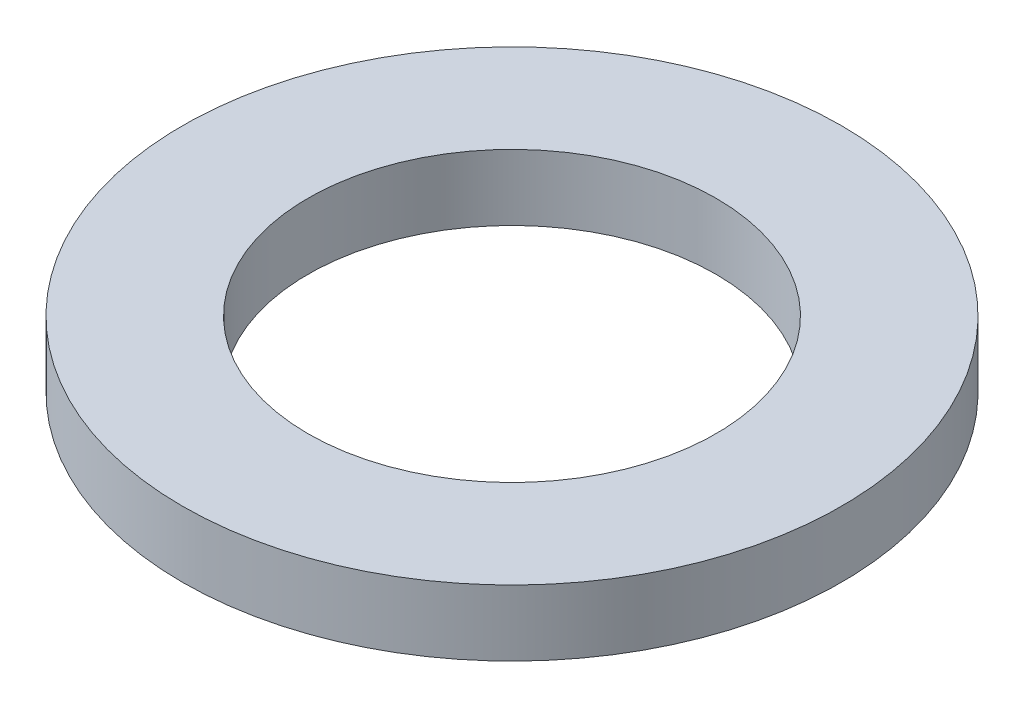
ISO-10303-21;
HEADER;
FILE_DESCRIPTION(('STEP AP214'),'2;1');
FILE_NAME('part.step','',(''),(''),'','','');
FILE_SCHEMA(('AUTOMOTIVE_DESIGN { 1 0 10303 214 1 1 1 1 }'));
ENDSEC;
DATA;
#1=APPLICATION_CONTEXT('core data for automotive mechanical design processes');
#2=APPLICATION_PROTOCOL_DEFINITION('international standard','automotive_design',2000,#1);
#3=PRODUCT_CONTEXT('',#1,'mechanical');
#4=PRODUCT('Part','Part','',(#3));
#5=PRODUCT_RELATED_PRODUCT_CATEGORY('part','',(#4));
#6=PRODUCT_DEFINITION_FORMATION('','',#4);
#7=PRODUCT_DEFINITION_CONTEXT('part definition',#1,'design');
#8=PRODUCT_DEFINITION('design','',#6,#7);
#9=PRODUCT_DEFINITION_SHAPE('','',#8);
#10=(LENGTH_UNIT() NAMED_UNIT(*) SI_UNIT(.MILLI.,.METRE.));
#11=(NAMED_UNIT(*) PLANE_ANGLE_UNIT() SI_UNIT($,.RADIAN.));
#12=(NAMED_UNIT(*) SI_UNIT($,.STERADIAN.) SOLID_ANGLE_UNIT());
#13=UNCERTAINTY_MEASURE_WITH_UNIT(LENGTH_MEASURE(1.E-05),#10,'distance_accuracy_value','');
#14=(GEOMETRIC_REPRESENTATION_CONTEXT(3) GLOBAL_UNCERTAINTY_ASSIGNED_CONTEXT((#13)) GLOBAL_UNIT_ASSIGNED_CONTEXT((#10,
#11,#12)) REPRESENTATION_CONTEXT('',''));
#15=CARTESIAN_POINT('',(0.,0.,0.));
#16=DIRECTION('',(0.,0.,1.));
#17=DIRECTION('',(1.,0.,0.));
#18=AXIS2_PLACEMENT_3D('',#15,#16,#17);
#19=CARTESIAN_POINT('',(0.,1.60020000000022,0.));
#20=DIRECTION('',(0.,1.,0.));
#21=DIRECTION('',(0.,0.,1.));
#22=AXIS2_PLACEMENT_3D('',#19,#20,#21);
#23=PLANE('',#22);
#24=CARTESIAN_POINT('',(0.,1.60020000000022,0.));
#25=DIRECTION('',(0.,-1.,0.));
#26=DIRECTION('',(0.,0.,-1.));
#27=AXIS2_PLACEMENT_3D('',#24,#25,#26);
#28=CIRCLE('',#27,4.953);
#29=CARTESIAN_POINT('',(0.,1.60020000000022,-4.95299999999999));
#30=VERTEX_POINT('',#29);
#31=EDGE_CURVE('E27',#30,#30,#28,.T.);
#32=ORIENTED_EDGE('',*,*,#31,.T.);
#33=EDGE_LOOP('',(#32));
#34=FACE_BOUND('',#33,.T.);
#35=CARTESIAN_POINT('',(0.,1.60020000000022,0.));
#36=DIRECTION('',(0.,-1.,0.));
#37=DIRECTION('',(0.,0.,-1.));
#38=AXIS2_PLACEMENT_3D('',#35,#36,#37);
#39=CIRCLE('',#38,8.001);
#40=CARTESIAN_POINT('',(0.,1.60020000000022,-8.00099999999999));
#41=VERTEX_POINT('',#40);
#42=EDGE_CURVE('E18',#41,#41,#39,.T.);
#43=ORIENTED_EDGE('',*,*,#42,.F.);
#44=EDGE_LOOP('',(#43));
#45=FACE_BOUND('',#44,.T.);
#46=ADVANCED_FACE('F15',(#34,#45),#23,.T.);
#47=CARTESIAN_POINT('',(0.,1.60020000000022,0.));
#48=DIRECTION('',(0.,-1.,0.));
#49=DIRECTION('',(0.,0.,-1.));
#50=AXIS2_PLACEMENT_3D('',#47,#48,#49);
#51=CYLINDRICAL_SURFACE('',#50,8.001);
#52=ORIENTED_EDGE('',*,*,#42,.T.);
#53=EDGE_LOOP('',(#52));
#54=FACE_BOUND('',#53,.T.);
#55=CARTESIAN_POINT('',(0.,0.,0.));
#56=DIRECTION('',(0.,-1.,0.));
#57=DIRECTION('',(0.,0.,-1.));
#58=AXIS2_PLACEMENT_3D('',#55,#56,#57);
#59=CIRCLE('',#58,8.001);
#60=CARTESIAN_POINT('',(0.,0.,-8.00099999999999));
#61=VERTEX_POINT('',#60);
#62=EDGE_CURVE('E22',#61,#61,#59,.F.);
#63=ORIENTED_EDGE('',*,*,#62,.T.);
#64=EDGE_LOOP('',(#63));
#65=FACE_BOUND('',#64,.T.);
#66=ADVANCED_FACE('F35',(#54,#65),#51,.T.);
#67=CARTESIAN_POINT('',(0.,1.60020000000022,0.));
#68=DIRECTION('',(0.,-1.,0.));
#69=DIRECTION('',(0.,0.,-1.));
#70=AXIS2_PLACEMENT_3D('',#67,#68,#69);
#71=CYLINDRICAL_SURFACE('',#70,4.953);
#72=CARTESIAN_POINT('',(0.,0.,0.));
#73=DIRECTION('',(0.,-1.,0.));
#74=DIRECTION('',(0.,0.,-1.));
#75=AXIS2_PLACEMENT_3D('',#72,#73,#74);
#76=CIRCLE('',#75,4.953);
#77=CARTESIAN_POINT('',(0.,0.,-4.95299999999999));
#78=VERTEX_POINT('',#77);
#79=EDGE_CURVE('E10',#78,#78,#76,.T.);
#80=ORIENTED_EDGE('',*,*,#79,.T.);
#81=EDGE_LOOP('',(#80));
#82=FACE_BOUND('',#81,.T.);
#83=ORIENTED_EDGE('',*,*,#31,.F.);
#84=EDGE_LOOP('',(#83));
#85=FACE_BOUND('',#84,.T.);
#86=ADVANCED_FACE('F43',(#82,#85),#71,.F.);
#87=CARTESIAN_POINT('',(0.,0.,0.));
#88=DIRECTION('',(0.,1.,0.));
#89=DIRECTION('',(0.,0.,1.));
#90=AXIS2_PLACEMENT_3D('',#87,#88,#89);
#91=PLANE('',#90);
#92=ORIENTED_EDGE('',*,*,#79,.F.);
#93=EDGE_LOOP('',(#92));
#94=FACE_BOUND('',#93,.T.);
#95=ORIENTED_EDGE('',*,*,#62,.F.);
#96=EDGE_LOOP('',(#95));
#97=FACE_BOUND('',#96,.T.);
#98=ADVANCED_FACE('F44',(#94,#97),#91,.F.);
#99=CLOSED_SHELL('',(#46,#66,#86,#98));
#100=MANIFOLD_SOLID_BREP('B1',#99);
#101=ADVANCED_BREP_SHAPE_REPRESENTATION('',(#18,#100),#14);
#102=SHAPE_DEFINITION_REPRESENTATION(#9,#101);
ENDSEC;
END-ISO-10303-21;
